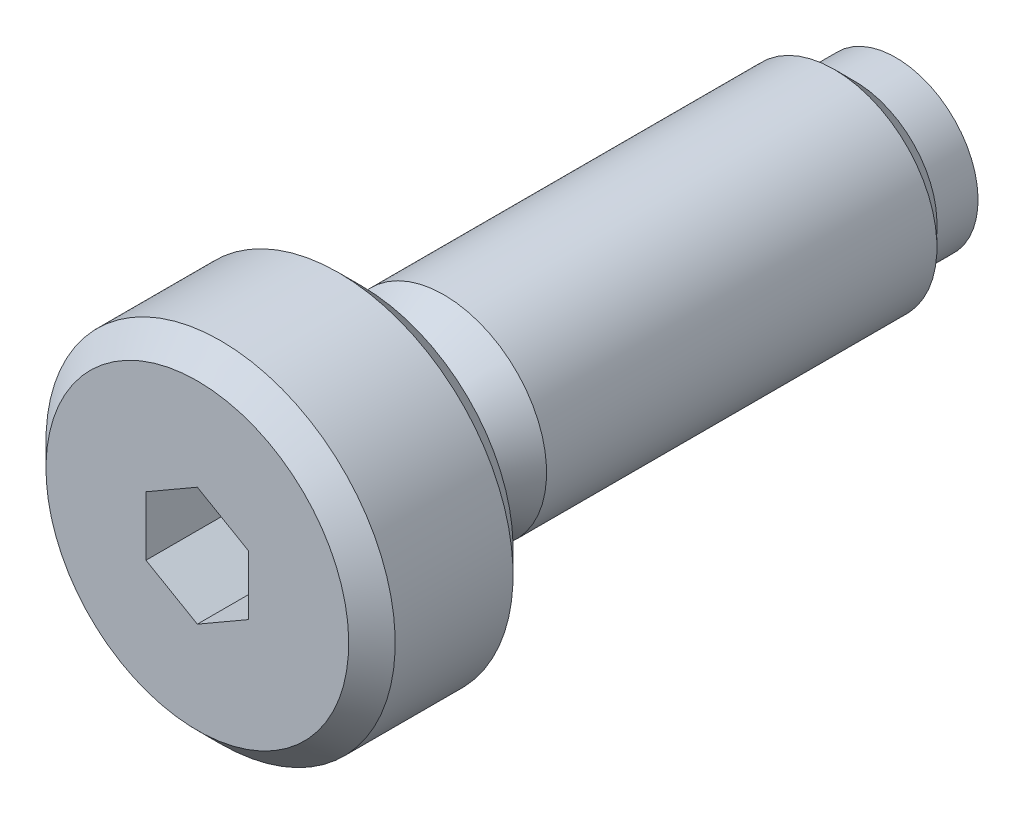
ISO-10303-21;
HEADER;
FILE_DESCRIPTION(('STEP AP214'),'2;1');
FILE_NAME('part.step','',(''),(''),'','','');
FILE_SCHEMA(('AUTOMOTIVE_DESIGN { 1 0 10303 214 1 1 1 1 }'));
ENDSEC;
DATA;
#1=APPLICATION_CONTEXT('core data for automotive mechanical design processes');
#2=APPLICATION_PROTOCOL_DEFINITION('international standard','automotive_design',2000,#1);
#3=PRODUCT_CONTEXT('',#1,'mechanical');
#4=PRODUCT('Part','Part','',(#3));
#5=PRODUCT_RELATED_PRODUCT_CATEGORY('part','',(#4));
#6=PRODUCT_DEFINITION_FORMATION('','',#4);
#7=PRODUCT_DEFINITION_CONTEXT('part definition',#1,'design');
#8=PRODUCT_DEFINITION('design','',#6,#7);
#9=PRODUCT_DEFINITION_SHAPE('','',#8);
#10=(LENGTH_UNIT() NAMED_UNIT(*) SI_UNIT(.MILLI.,.METRE.));
#11=(NAMED_UNIT(*) PLANE_ANGLE_UNIT() SI_UNIT($,.RADIAN.));
#12=(NAMED_UNIT(*) SI_UNIT($,.STERADIAN.) SOLID_ANGLE_UNIT());
#13=UNCERTAINTY_MEASURE_WITH_UNIT(LENGTH_MEASURE(1.E-05),#10,'distance_accuracy_value','');
#14=(GEOMETRIC_REPRESENTATION_CONTEXT(3) GLOBAL_UNCERTAINTY_ASSIGNED_CONTEXT((#13)) GLOBAL_UNIT_ASSIGNED_CONTEXT((#10,
#11,#12)) REPRESENTATION_CONTEXT('',''));
#15=CARTESIAN_POINT('',(0.,0.,0.));
#16=DIRECTION('',(0.,0.,1.));
#17=DIRECTION('',(1.,0.,0.));
#18=AXIS2_PLACEMENT_3D('',#15,#16,#17);
#19=CARTESIAN_POINT('',(-3.43431457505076,0.,13.9));
#20=DIRECTION('',(0.,0.,1.));
#21=DIRECTION('',(0.,1.,0.));
#22=AXIS2_PLACEMENT_3D('',#19,#20,#21);
#23=PLANE('',#22);
#24=CARTESIAN_POINT('',(0.,0.,13.9));
#25=DIRECTION('',(0.,0.,-1.));
#26=DIRECTION('',(0.,-1.,0.));
#27=AXIS2_PLACEMENT_3D('',#24,#25,#26);
#28=CIRCLE('',#27,2.25);
#29=CARTESIAN_POINT('',(0.,-2.25,13.9));
#30=VERTEX_POINT('',#29);
#31=EDGE_CURVE('E9',#30,#30,#28,.T.);
#32=ORIENTED_EDGE('',*,*,#31,.F.);
#33=EDGE_LOOP('',(#32));
#34=FACE_BOUND('',#33,.T.);
#35=CARTESIAN_POINT('',(0.,0.,13.9));
#36=DIRECTION('',(0.,0.,1.));
#37=DIRECTION('',(0.,1.,0.));
#38=AXIS2_PLACEMENT_3D('',#35,#36,#37);
#39=CIRCLE('',#38,3.68431457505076);
#40=CARTESIAN_POINT('',(0.,3.68431457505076,13.9));
#41=VERTEX_POINT('',#40);
#42=EDGE_CURVE('E115',#41,#41,#39,.T.);
#43=ORIENTED_EDGE('',*,*,#42,.F.);
#44=EDGE_LOOP('',(#43));
#45=FACE_BOUND('',#44,.T.);
#46=ADVANCED_FACE('F14',(#34,#45),#23,.F.);
#47=CARTESIAN_POINT('',(0.,0.,13.5));
#48=DIRECTION('',(0.,0.,-1.));
#49=DIRECTION('',(0.,-1.,0.));
#50=AXIS2_PLACEMENT_3D('',#47,#48,#49);
#51=TOROIDAL_SURFACE('',#50,2.25,0.4);
#52=CARTESIAN_POINT('',(0.,0.,13.5));
#53=DIRECTION('',(0.,0.,-1.));
#54=DIRECTION('',(0.,-1.,0.));
#55=AXIS2_PLACEMENT_3D('',#52,#53,#54);
#56=CIRCLE('',#55,1.85);
#57=CARTESIAN_POINT('',(0.,-1.85,13.5));
#58=VERTEX_POINT('',#57);
#59=EDGE_CURVE('E23',#58,#58,#56,.T.);
#60=ORIENTED_EDGE('',*,*,#59,.F.);
#61=EDGE_LOOP('',(#60));
#62=FACE_BOUND('',#61,.T.);
#63=ORIENTED_EDGE('',*,*,#31,.T.);
#64=EDGE_LOOP('',(#63));
#65=FACE_BOUND('',#64,.T.);
#66=ADVANCED_FACE('F150',(#62,#65),#51,.F.);
#67=CARTESIAN_POINT('',(0.,0.,0.9));
#68=DIRECTION('',(0.,0.,-1.));
#69=DIRECTION('',(0.,-1.,0.));
#70=AXIS2_PLACEMENT_3D('',#67,#68,#69);
#71=CYLINDRICAL_SURFACE('',#70,1.85);
#72=CARTESIAN_POINT('',(0.,0.,13.1330127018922));
#73=DIRECTION('',(0.,0.,-1.));
#74=DIRECTION('',(0.,-1.,0.));
#75=AXIS2_PLACEMENT_3D('',#72,#73,#74);
#76=CIRCLE('',#75,1.85);
#77=CARTESIAN_POINT('',(0.,-1.85,13.1330127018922));
#78=VERTEX_POINT('',#77);
#79=EDGE_CURVE('E142',#78,#78,#76,.T.);
#80=ORIENTED_EDGE('',*,*,#79,.F.);
#81=EDGE_LOOP('',(#80));
#82=FACE_BOUND('',#81,.T.);
#83=ORIENTED_EDGE('',*,*,#59,.T.);
#84=EDGE_LOOP('',(#83));
#85=FACE_BOUND('',#84,.T.);
#86=ADVANCED_FACE('F148',(#82,#85),#71,.T.);
#87=CARTESIAN_POINT('',(0.,0.,13.1330127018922));
#88=DIRECTION('',(0.,0.,-1.));
#89=DIRECTION('',(0.,-1.,0.));
#90=AXIS2_PLACEMENT_3D('',#87,#88,#89);
#91=TOROIDAL_SURFACE('',#90,2.25,0.399999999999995);
#92=CARTESIAN_POINT('',(0.,0.,12.9330127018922));
#93=DIRECTION('',(0.,0.,-1.));
#94=DIRECTION('',(0.,-1.,0.));
#95=AXIS2_PLACEMENT_3D('',#92,#93,#94);
#96=CIRCLE('',#95,1.90358983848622);
#97=CARTESIAN_POINT('',(0.,-1.90358983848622,12.9330127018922));
#98=VERTEX_POINT('',#97);
#99=EDGE_CURVE('E139',#98,#98,#96,.T.);
#100=ORIENTED_EDGE('',*,*,#99,.F.);
#101=EDGE_LOOP('',(#100));
#102=FACE_BOUND('',#101,.T.);
#103=ORIENTED_EDGE('',*,*,#79,.T.);
#104=EDGE_LOOP('',(#103));
#105=FACE_BOUND('',#104,.T.);
#106=ADVANCED_FACE('F205',(#102,#105),#91,.F.);
#107=CARTESIAN_POINT('',(0.,0.,12.9330127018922));
#108=DIRECTION('',(0.,0.,-1.));
#109=DIRECTION('',(0.,-1.,0.));
#110=AXIS2_PLACEMENT_3D('',#107,#108,#109);
#111=CONICAL_SURFACE('',#110,1.90358983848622,0.523598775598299);
#112=CARTESIAN_POINT('',(0.,0.,11.9));
#113=DIRECTION('',(0.,0.,-1.));
#114=DIRECTION('',(0.,-1.,0.));
#115=AXIS2_PLACEMENT_3D('',#112,#113,#114);
#116=CIRCLE('',#115,2.5);
#117=CARTESIAN_POINT('',(0.,-2.5,11.9));
#118=VERTEX_POINT('',#117);
#119=EDGE_CURVE('E136',#118,#118,#116,.T.);
#120=ORIENTED_EDGE('',*,*,#119,.F.);
#121=EDGE_LOOP('',(#120));
#122=FACE_BOUND('',#121,.T.);
#123=ORIENTED_EDGE('',*,*,#99,.T.);
#124=EDGE_LOOP('',(#123));
#125=FACE_BOUND('',#124,.T.);
#126=ADVANCED_FACE('F201',(#122,#125),#111,.T.);
#127=CARTESIAN_POINT('',(0.,0.,0.9));
#128=DIRECTION('',(0.,0.,-1.));
#129=DIRECTION('',(0.,-1.,0.));
#130=AXIS2_PLACEMENT_3D('',#127,#128,#129);
#131=CYLINDRICAL_SURFACE('',#130,2.5);
#132=CARTESIAN_POINT('',(0.,0.,2.4));
#133=DIRECTION('',(0.,0.,-1.));
#134=DIRECTION('',(0.,-1.,0.));
#135=AXIS2_PLACEMENT_3D('',#132,#133,#134);
#136=CIRCLE('',#135,2.5);
#137=CARTESIAN_POINT('',(0.,-2.5,2.4));
#138=VERTEX_POINT('',#137);
#139=EDGE_CURVE('E133',#138,#138,#136,.T.);
#140=ORIENTED_EDGE('',*,*,#139,.F.);
#141=EDGE_LOOP('',(#140));
#142=FACE_BOUND('',#141,.T.);
#143=ORIENTED_EDGE('',*,*,#119,.T.);
#144=EDGE_LOOP('',(#143));
#145=FACE_BOUND('',#144,.T.);
#146=ADVANCED_FACE('F197',(#142,#145),#131,.T.);
#147=CARTESIAN_POINT('',(0.,0.,2.4));
#148=DIRECTION('',(0.,0.,1.));
#149=DIRECTION('',(0.,1.,0.));
#150=AXIS2_PLACEMENT_3D('',#147,#148,#149);
#151=CONICAL_SURFACE('',#150,2.5,0.785398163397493);
#152=CARTESIAN_POINT('',(0.,0.,1.9));
#153=DIRECTION('',(0.,0.,-1.));
#154=DIRECTION('',(0.,-1.,0.));
#155=AXIS2_PLACEMENT_3D('',#152,#153,#154);
#156=CIRCLE('',#155,2.);
#157=CARTESIAN_POINT('',(0.,-2.,1.9));
#158=VERTEX_POINT('',#157);
#159=EDGE_CURVE('E130',#158,#158,#156,.T.);
#160=ORIENTED_EDGE('',*,*,#159,.F.);
#161=EDGE_LOOP('',(#160));
#162=FACE_BOUND('',#161,.T.);
#163=ORIENTED_EDGE('',*,*,#139,.T.);
#164=EDGE_LOOP('',(#163));
#165=FACE_BOUND('',#164,.T.);
#166=ADVANCED_FACE('F193',(#162,#165),#151,.T.);
#167=CARTESIAN_POINT('',(0.,0.,0.9));
#168=DIRECTION('',(0.,0.,-1.));
#169=DIRECTION('',(0.,-1.,0.));
#170=AXIS2_PLACEMENT_3D('',#167,#168,#169);
#171=CYLINDRICAL_SURFACE('',#170,2.);
#172=CARTESIAN_POINT('',(0.,0.,0.9));
#173=DIRECTION('',(0.,0.,-1.));
#174=DIRECTION('',(0.,-1.,0.));
#175=AXIS2_PLACEMENT_3D('',#172,#173,#174);
#176=CIRCLE('',#175,2.);
#177=CARTESIAN_POINT('',(0.,-2.,0.9));
#178=VERTEX_POINT('',#177);
#179=EDGE_CURVE('E127',#178,#178,#176,.T.);
#180=ORIENTED_EDGE('',*,*,#179,.F.);
#181=EDGE_LOOP('',(#180));
#182=FACE_BOUND('',#181,.T.);
#183=ORIENTED_EDGE('',*,*,#159,.T.);
#184=EDGE_LOOP('',(#183));
#185=FACE_BOUND('',#184,.T.);
#186=ADVANCED_FACE('F189',(#182,#185),#171,.T.);
#187=CARTESIAN_POINT('',(-2.,0.,0.9));
#188=DIRECTION('',(0.,0.,1.));
#189=DIRECTION('',(0.,1.,0.));
#190=AXIS2_PLACEMENT_3D('',#187,#188,#189);
#191=PLANE('',#190);
#192=ORIENTED_EDGE('',*,*,#179,.T.);
#193=EDGE_LOOP('',(#192));
#194=FACE_BOUND('',#193,.T.);
#195=CARTESIAN_POINT('',(0.,0.,0.9));
#196=DIRECTION('',(0.,0.,-1.));
#197=DIRECTION('',(0.,-1.,0.));
#198=AXIS2_PLACEMENT_3D('',#195,#196,#197);
#199=CIRCLE('',#198,1.37477270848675);
#200=CARTESIAN_POINT('',(0.,-1.37477270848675,0.9));
#201=VERTEX_POINT('',#200);
#202=EDGE_CURVE('E18',#201,#201,#199,.T.);
#203=ORIENTED_EDGE('',*,*,#202,.F.);
#204=EDGE_LOOP('',(#203));
#205=FACE_BOUND('',#204,.T.);
#206=ADVANCED_FACE('F180',(#194,#205),#191,.F.);
#207=CARTESIAN_POINT('',(0.,0.,17.3343145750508));
#208=DIRECTION('',(0.,0.,-1.));
#209=DIRECTION('',(0.,-1.,0.));
#210=AXIS2_PLACEMENT_3D('',#207,#208,#209);
#211=CONICAL_SURFACE('',#210,4.25,0.785398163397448);
#212=CARTESIAN_POINT('',(0.,0.,17.9));
#213=DIRECTION('',(0.,0.,1.));
#214=DIRECTION('',(0.,1.,0.));
#215=AXIS2_PLACEMENT_3D('',#212,#213,#214);
#216=CIRCLE('',#215,3.68431457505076);
#217=CARTESIAN_POINT('',(0.,3.68431457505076,17.9));
#218=VERTEX_POINT('',#217);
#219=EDGE_CURVE('E124',#218,#218,#216,.T.);
#220=ORIENTED_EDGE('',*,*,#219,.F.);
#221=EDGE_LOOP('',(#220));
#222=FACE_BOUND('',#221,.T.);
#223=CARTESIAN_POINT('',(0.,0.,17.3343145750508));
#224=DIRECTION('',(0.,0.,1.));
#225=DIRECTION('',(0.,1.,0.));
#226=AXIS2_PLACEMENT_3D('',#223,#224,#225);
#227=CIRCLE('',#226,4.25);
#228=CARTESIAN_POINT('',(0.,4.25,17.3343145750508));
#229=VERTEX_POINT('',#228);
#230=EDGE_CURVE('E121',#229,#229,#227,.T.);
#231=ORIENTED_EDGE('',*,*,#230,.T.);
#232=EDGE_LOOP('',(#231));
#233=FACE_BOUND('',#232,.T.);
#234=ADVANCED_FACE('F171',(#222,#233),#211,.T.);
#235=CARTESIAN_POINT('',(0.,0.,17.3343145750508));
#236=DIRECTION('',(0.,0.,1.));
#237=DIRECTION('',(0.,1.,0.));
#238=AXIS2_PLACEMENT_3D('',#235,#236,#237);
#239=CYLINDRICAL_SURFACE('',#238,4.25);
#240=ORIENTED_EDGE('',*,*,#230,.F.);
#241=EDGE_LOOP('',(#240));
#242=FACE_BOUND('',#241,.T.);
#243=CARTESIAN_POINT('',(0.,0.,14.4656854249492));
#244=DIRECTION('',(0.,0.,1.));
#245=DIRECTION('',(0.,1.,0.));
#246=AXIS2_PLACEMENT_3D('',#243,#244,#245);
#247=CIRCLE('',#246,4.25);
#248=CARTESIAN_POINT('',(0.,4.25,14.4656854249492));
#249=VERTEX_POINT('',#248);
#250=EDGE_CURVE('E118',#249,#249,#247,.T.);
#251=ORIENTED_EDGE('',*,*,#250,.T.);
#252=EDGE_LOOP('',(#251));
#253=FACE_BOUND('',#252,.T.);
#254=ADVANCED_FACE('F162',(#242,#253),#239,.T.);
#255=CARTESIAN_POINT('',(0.,0.,13.9));
#256=DIRECTION('',(0.,0.,1.));
#257=DIRECTION('',(0.,1.,0.));
#258=AXIS2_PLACEMENT_3D('',#255,#256,#257);
#259=CONICAL_SURFACE('',#258,3.68431457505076,0.785398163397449);
#260=ORIENTED_EDGE('',*,*,#250,.F.);
#261=EDGE_LOOP('',(#260));
#262=FACE_BOUND('',#261,.T.);
#263=ORIENTED_EDGE('',*,*,#42,.T.);
#264=EDGE_LOOP('',(#263));
#265=FACE_BOUND('',#264,.T.);
#266=ADVANCED_FACE('F160',(#262,#265),#259,.T.);
#267=CARTESIAN_POINT('',(0.,0.,17.9));
#268=DIRECTION('',(0.,0.,-1.));
#269=DIRECTION('',(0.,-1.,0.));
#270=AXIS2_PLACEMENT_3D('',#267,#268,#269);
#271=PLANE('',#270);
#272=DIRECTION('',(-0.866025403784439,-0.5,0.));
#273=VECTOR('',#272,1.);
#274=CARTESIAN_POINT('',(0.,1.44337567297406,17.9));
#275=LINE('',#274,#273);
#276=CARTESIAN_POINT('',(0.,1.44337567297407,17.9));
#277=VERTEX_POINT('',#276);
#278=CARTESIAN_POINT('',(-1.25,0.721687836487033,17.9));
#279=VERTEX_POINT('',#278);
#280=EDGE_CURVE('E88',#277,#279,#275,.T.);
#281=ORIENTED_EDGE('',*,*,#280,.F.);
#282=DIRECTION('',(-0.866025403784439,0.5,0.));
#283=VECTOR('',#282,1.);
#284=CARTESIAN_POINT('',(1.25,0.721687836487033,17.9));
#285=LINE('',#284,#283);
#286=CARTESIAN_POINT('',(1.25,0.721687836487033,17.9));
#287=VERTEX_POINT('',#286);
#288=EDGE_CURVE('E30',#287,#277,#285,.T.);
#289=ORIENTED_EDGE('',*,*,#288,.F.);
#290=DIRECTION('',(0.,1.,0.));
#291=VECTOR('',#290,1.);
#292=CARTESIAN_POINT('',(1.25,-0.721687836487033,17.9));
#293=LINE('',#292,#291);
#294=CARTESIAN_POINT('',(1.25,-0.721687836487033,17.9));
#295=VERTEX_POINT('',#294);
#296=EDGE_CURVE('E103',#295,#287,#293,.T.);
#297=ORIENTED_EDGE('',*,*,#296,.F.);
#298=DIRECTION('',(0.866025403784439,0.5,0.));
#299=VECTOR('',#298,1.);
#300=CARTESIAN_POINT('',(0.,-1.44337567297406,17.9));
#301=LINE('',#300,#299);
#302=CARTESIAN_POINT('',(0.,-1.44337567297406,17.9));
#303=VERTEX_POINT('',#302);
#304=EDGE_CURVE('E97',#303,#295,#301,.T.);
#305=ORIENTED_EDGE('',*,*,#304,.F.);
#306=DIRECTION('',(0.866025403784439,-0.5,0.));
#307=VECTOR('',#306,1.);
#308=CARTESIAN_POINT('',(-1.25,-0.721687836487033,17.9));
#309=LINE('',#308,#307);
#310=CARTESIAN_POINT('',(-1.25,-0.721687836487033,17.9));
#311=VERTEX_POINT('',#310);
#312=EDGE_CURVE('E95',#311,#303,#309,.T.);
#313=ORIENTED_EDGE('',*,*,#312,.F.);
#314=DIRECTION('',(0.,-1.,0.));
#315=VECTOR('',#314,1.);
#316=CARTESIAN_POINT('',(-1.25,0.721687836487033,17.9));
#317=LINE('',#316,#315);
#318=EDGE_CURVE('E81',#279,#311,#317,.T.);
#319=ORIENTED_EDGE('',*,*,#318,.F.);
#320=EDGE_LOOP('',(#281,#289,#297,#305,#313,#319));
#321=FACE_BOUND('',#320,.T.);
#322=ORIENTED_EDGE('',*,*,#219,.T.);
#323=EDGE_LOOP('',(#322));
#324=FACE_BOUND('',#323,.T.);
#325=ADVANCED_FACE('F16',(#321,#324),#271,.F.);
#326=CARTESIAN_POINT('',(1.25,0.721687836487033,11.0811869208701));
#327=DIRECTION('',(0.5,0.866025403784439,0.));
#328=DIRECTION('',(0.866025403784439,-0.5,0.));
#329=AXIS2_PLACEMENT_3D('',#326,#327,#328);
#330=PLANE('',#329);
#331=DIRECTION('',(0.866025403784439,-0.5,0.));
#332=VECTOR('',#331,1.);
#333=CARTESIAN_POINT('',(1.25,0.721687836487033,14.9));
#334=LINE('',#333,#332);
#335=CARTESIAN_POINT('',(0.,1.44337567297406,14.9));
#336=VERTEX_POINT('',#335);
#337=CARTESIAN_POINT('',(1.25,0.721687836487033,14.9));
#338=VERTEX_POINT('',#337);
#339=EDGE_CURVE('E49',#336,#338,#334,.T.);
#340=ORIENTED_EDGE('',*,*,#339,.T.);
#341=DIRECTION('',(0.,0.,1.));
#342=VECTOR('',#341,1.);
#343=CARTESIAN_POINT('',(1.25,0.721687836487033,11.0811869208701));
#344=LINE('',#343,#342);
#345=EDGE_CURVE('E106',#338,#287,#344,.T.);
#346=ORIENTED_EDGE('',*,*,#345,.T.);
#347=ORIENTED_EDGE('',*,*,#288,.T.);
#348=DIRECTION('',(0.,0.,1.));
#349=VECTOR('',#348,1.);
#350=CARTESIAN_POINT('',(0.,1.44337567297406,11.0811869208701));
#351=LINE('',#350,#349);
#352=EDGE_CURVE('E85',#336,#277,#351,.T.);
#353=ORIENTED_EDGE('',*,*,#352,.F.);
#354=EDGE_LOOP('',(#340,#346,#347,#353));
#355=FACE_BOUND('',#354,.T.);
#356=ADVANCED_FACE('F170',(#355),#330,.F.);
#357=CARTESIAN_POINT('',(1.25,-0.721687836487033,11.0811869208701));
#358=DIRECTION('',(1.,0.,0.));
#359=DIRECTION('',(0.,-1.,0.));
#360=AXIS2_PLACEMENT_3D('',#357,#358,#359);
#361=PLANE('',#360);
#362=DIRECTION('',(0.,-1.,0.));
#363=VECTOR('',#362,1.);
#364=CARTESIAN_POINT('',(1.25,-0.721687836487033,14.9));
#365=LINE('',#364,#363);
#366=CARTESIAN_POINT('',(1.25,-0.721687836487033,14.9));
#367=VERTEX_POINT('',#366);
#368=EDGE_CURVE('E342',#338,#367,#365,.T.);
#369=ORIENTED_EDGE('',*,*,#368,.T.);
#370=DIRECTION('',(0.,0.,1.));
#371=VECTOR('',#370,1.);
#372=CARTESIAN_POINT('',(1.25,-0.721687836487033,11.0811869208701));
#373=LINE('',#372,#371);
#374=EDGE_CURVE('E108',#367,#295,#373,.T.);
#375=ORIENTED_EDGE('',*,*,#374,.T.);
#376=ORIENTED_EDGE('',*,*,#296,.T.);
#377=ORIENTED_EDGE('',*,*,#345,.F.);
#378=EDGE_LOOP('',(#369,#375,#376,#377));
#379=FACE_BOUND('',#378,.T.);
#380=ADVANCED_FACE('F274',(#379),#361,.F.);
#381=CARTESIAN_POINT('',(0.,-1.44337567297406,11.0811869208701));
#382=DIRECTION('',(0.5,-0.866025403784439,0.));
#383=DIRECTION('',(-0.866025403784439,-0.5,0.));
#384=AXIS2_PLACEMENT_3D('',#381,#382,#383);
#385=PLANE('',#384);
#386=DIRECTION('',(-0.866025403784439,-0.5,0.));
#387=VECTOR('',#386,1.);
#388=CARTESIAN_POINT('',(0.,-1.44337567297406,14.9));
#389=LINE('',#388,#387);
#390=CARTESIAN_POINT('',(0.,-1.44337567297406,14.9));
#391=VERTEX_POINT('',#390);
#392=EDGE_CURVE('E344',#367,#391,#389,.T.);
#393=ORIENTED_EDGE('',*,*,#392,.T.);
#394=DIRECTION('',(0.,0.,1.));
#395=VECTOR('',#394,1.);
#396=CARTESIAN_POINT('',(0.,-1.44337567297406,11.0811869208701));
#397=LINE('',#396,#395);
#398=EDGE_CURVE('E110',#391,#303,#397,.T.);
#399=ORIENTED_EDGE('',*,*,#398,.T.);
#400=ORIENTED_EDGE('',*,*,#304,.T.);
#401=ORIENTED_EDGE('',*,*,#374,.F.);
#402=EDGE_LOOP('',(#393,#399,#400,#401));
#403=FACE_BOUND('',#402,.T.);
#404=ADVANCED_FACE('F282',(#403),#385,.F.);
#405=CARTESIAN_POINT('',(-1.25,-0.721687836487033,11.0811869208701));
#406=DIRECTION('',(-0.5,-0.866025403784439,0.));
#407=DIRECTION('',(-0.866025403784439,0.5,0.));
#408=AXIS2_PLACEMENT_3D('',#405,#406,#407);
#409=PLANE('',#408);
#410=DIRECTION('',(-0.866025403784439,0.5,0.));
#411=VECTOR('',#410,1.);
#412=CARTESIAN_POINT('',(-1.25,-0.721687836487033,14.9));
#413=LINE('',#412,#411);
#414=CARTESIAN_POINT('',(-1.25,-0.721687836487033,14.9));
#415=VERTEX_POINT('',#414);
#416=EDGE_CURVE('E39',#391,#415,#413,.T.);
#417=ORIENTED_EDGE('',*,*,#416,.T.);
#418=DIRECTION('',(0.,0.,1.));
#419=VECTOR('',#418,1.);
#420=CARTESIAN_POINT('',(-1.25,-0.721687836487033,11.0811869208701));
#421=LINE('',#420,#419);
#422=EDGE_CURVE('E84',#415,#311,#421,.T.);
#423=ORIENTED_EDGE('',*,*,#422,.T.);
#424=ORIENTED_EDGE('',*,*,#312,.T.);
#425=ORIENTED_EDGE('',*,*,#398,.F.);
#426=EDGE_LOOP('',(#417,#423,#424,#425));
#427=FACE_BOUND('',#426,.T.);
#428=ADVANCED_FACE('F292',(#427),#409,.F.);
#429=CARTESIAN_POINT('',(-1.25,0.721687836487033,11.0811869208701));
#430=DIRECTION('',(-1.,0.,0.));
#431=DIRECTION('',(0.,1.,0.));
#432=AXIS2_PLACEMENT_3D('',#429,#430,#431);
#433=PLANE('',#432);
#434=DIRECTION('',(0.,1.,0.));
#435=VECTOR('',#434,1.);
#436=CARTESIAN_POINT('',(-1.25,0.721687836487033,14.9));
#437=LINE('',#436,#435);
#438=CARTESIAN_POINT('',(-1.25,0.721687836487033,14.9));
#439=VERTEX_POINT('',#438);
#440=EDGE_CURVE('E83',#415,#439,#437,.T.);
#441=ORIENTED_EDGE('',*,*,#440,.T.);
#442=DIRECTION('',(0.,0.,1.));
#443=VECTOR('',#442,1.);
#444=CARTESIAN_POINT('',(-1.25,0.721687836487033,11.0811869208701));
#445=LINE('',#444,#443);
#446=EDGE_CURVE('E76',#439,#279,#445,.T.);
#447=ORIENTED_EDGE('',*,*,#446,.T.);
#448=ORIENTED_EDGE('',*,*,#318,.T.);
#449=ORIENTED_EDGE('',*,*,#422,.F.);
#450=EDGE_LOOP('',(#441,#447,#448,#449));
#451=FACE_BOUND('',#450,.T.);
#452=ADVANCED_FACE('F78',(#451),#433,.F.);
#453=CARTESIAN_POINT('',(0.,1.44337567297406,11.0811869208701));
#454=DIRECTION('',(-0.5,0.866025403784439,0.));
#455=DIRECTION('',(0.866025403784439,0.5,0.));
#456=AXIS2_PLACEMENT_3D('',#453,#454,#455);
#457=PLANE('',#456);
#458=DIRECTION('',(0.866025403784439,0.5,0.));
#459=VECTOR('',#458,1.);
#460=CARTESIAN_POINT('',(0.,1.44337567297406,14.9));
#461=LINE('',#460,#459);
#462=EDGE_CURVE('E58',#439,#336,#461,.T.);
#463=ORIENTED_EDGE('',*,*,#462,.T.);
#464=ORIENTED_EDGE('',*,*,#352,.T.);
#465=ORIENTED_EDGE('',*,*,#280,.T.);
#466=ORIENTED_EDGE('',*,*,#446,.F.);
#467=EDGE_LOOP('',(#463,#464,#465,#466));
#468=FACE_BOUND('',#467,.T.);
#469=ADVANCED_FACE('F89',(#468),#457,.F.);
#470=CARTESIAN_POINT('',(0.,0.,14.9));
#471=DIRECTION('',(0.,0.,1.));
#472=DIRECTION('',(0.,1.,0.));
#473=AXIS2_PLACEMENT_3D('',#470,#471,#472);
#474=PLANE('',#473);
#475=ORIENTED_EDGE('',*,*,#339,.F.);
#476=ORIENTED_EDGE('',*,*,#462,.F.);
#477=ORIENTED_EDGE('',*,*,#440,.F.);
#478=ORIENTED_EDGE('',*,*,#416,.F.);
#479=ORIENTED_EDGE('',*,*,#392,.F.);
#480=ORIENTED_EDGE('',*,*,#368,.F.);
#481=EDGE_LOOP('',(#475,#476,#477,#478,#479,#480));
#482=FACE_BOUND('',#481,.T.);
#483=ADVANCED_FACE('F182',(#482),#474,.T.);
#484=CARTESIAN_POINT('',(0.,0.,1.5));
#485=DIRECTION('',(0.,0.,1.));
#486=DIRECTION('',(0.,-1.,0.));
#487=AXIS2_PLACEMENT_3D('',#484,#485,#486);
#488=SPHERICAL_SURFACE('',#487,1.5);
#489=ORIENTED_EDGE('',*,*,#202,.T.);
#490=EDGE_LOOP('',(#489));
#491=FACE_BOUND('',#490,.T.);
#492=ADVANCED_FACE('F185',(#491),#488,.T.);
#493=CLOSED_SHELL('',(#46,#66,#86,#106,#126,#146,#166,#186,#206,#234,#254,#266,#325,#356,#380,
#404,#428,#452,#469,#483,#492));
#494=MANIFOLD_SOLID_BREP('B1',#493);
#495=ADVANCED_BREP_SHAPE_REPRESENTATION('',(#18,#494),#14);
#496=SHAPE_DEFINITION_REPRESENTATION(#9,#495);
ENDSEC;
END-ISO-10303-21;
